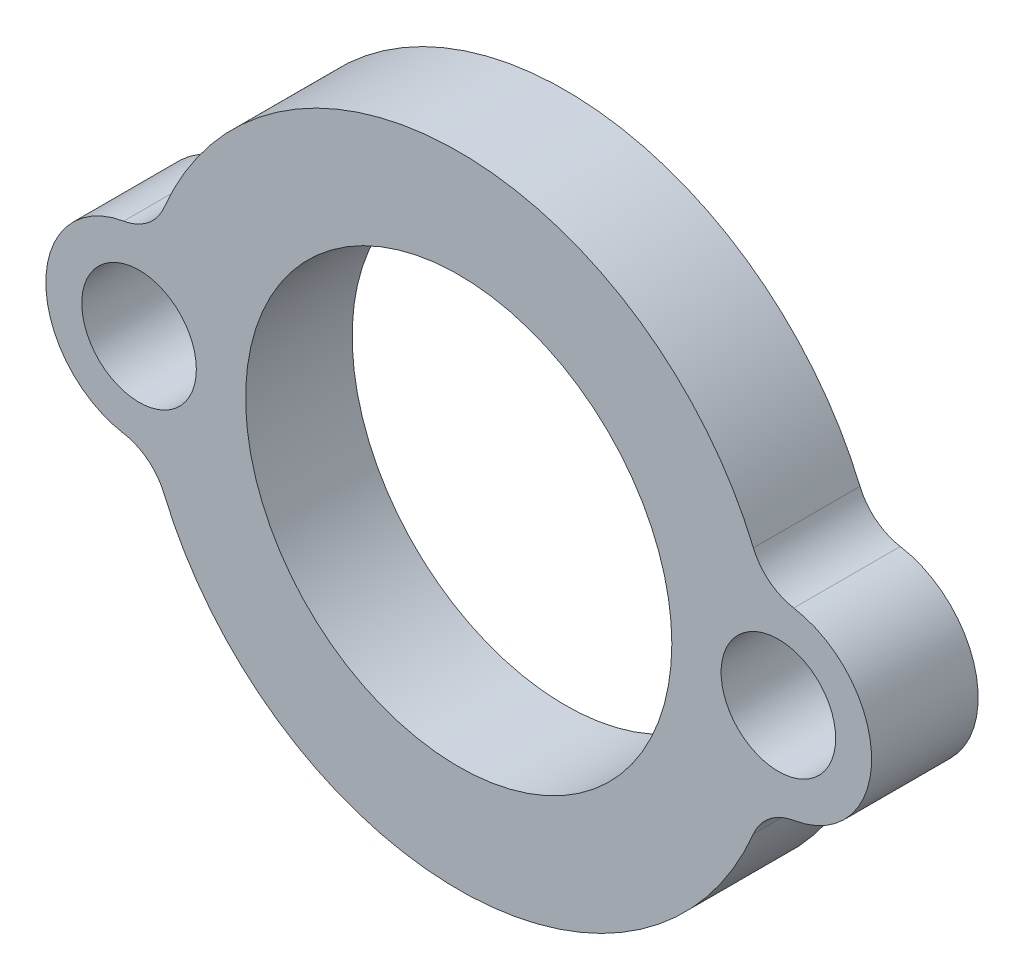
from build123d import *

# Parameters (mm, degrees)
ESQUISSE1_R        = 8
ESQUISSE1_R_2      = 2.15
BOSS_EXTRU_1_DEPTH = 4
CONG_1_R           = 2


with BuildPart() as part:
    # Esquisse1 → Boss.-Extru.1 (new body)
    with BuildSketch(Plane.XY):
        with BuildLine():
            ThreePointArc((-11.489583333, -3.462582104), (0, -12), (11.489583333, -3.462582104))
            ThreePointArc((11.489583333, -3.462582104), (15.5, 0), (11.489583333, 3.462582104))
            ThreePointArc((11.489583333, 3.462582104), (0, 12), (-11.489583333, 3.462582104))
            ThreePointArc((-11.489583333, 3.462582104), (-15.5, 0), (-11.489583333, -3.462582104))
        make_face()
        Circle(ESQUISSE1_R, mode=Mode.SUBTRACT)
        with Locations((12, 0)):
            Circle(ESQUISSE1_R_2, mode=Mode.SUBTRACT)
        with Locations((-12, 0)):
            Circle(ESQUISSE1_R_2, mode=Mode.SUBTRACT)
    extrude(amount=BOSS_EXTRU_1_DEPTH)

    # Cong_1
    cong_1_edges = [part.edges().sort_by_distance(p)[0] for p in [
        (11.489583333, 3.462582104, 2),
        (11.489583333, -3.462582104, 2),
        (-11.489583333, -3.462582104, 2),
        (-11.489583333, 3.462582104, 2),
    ]]
    fillet(cong_1_edges, radius=CONG_1_R)


solid = part.part
